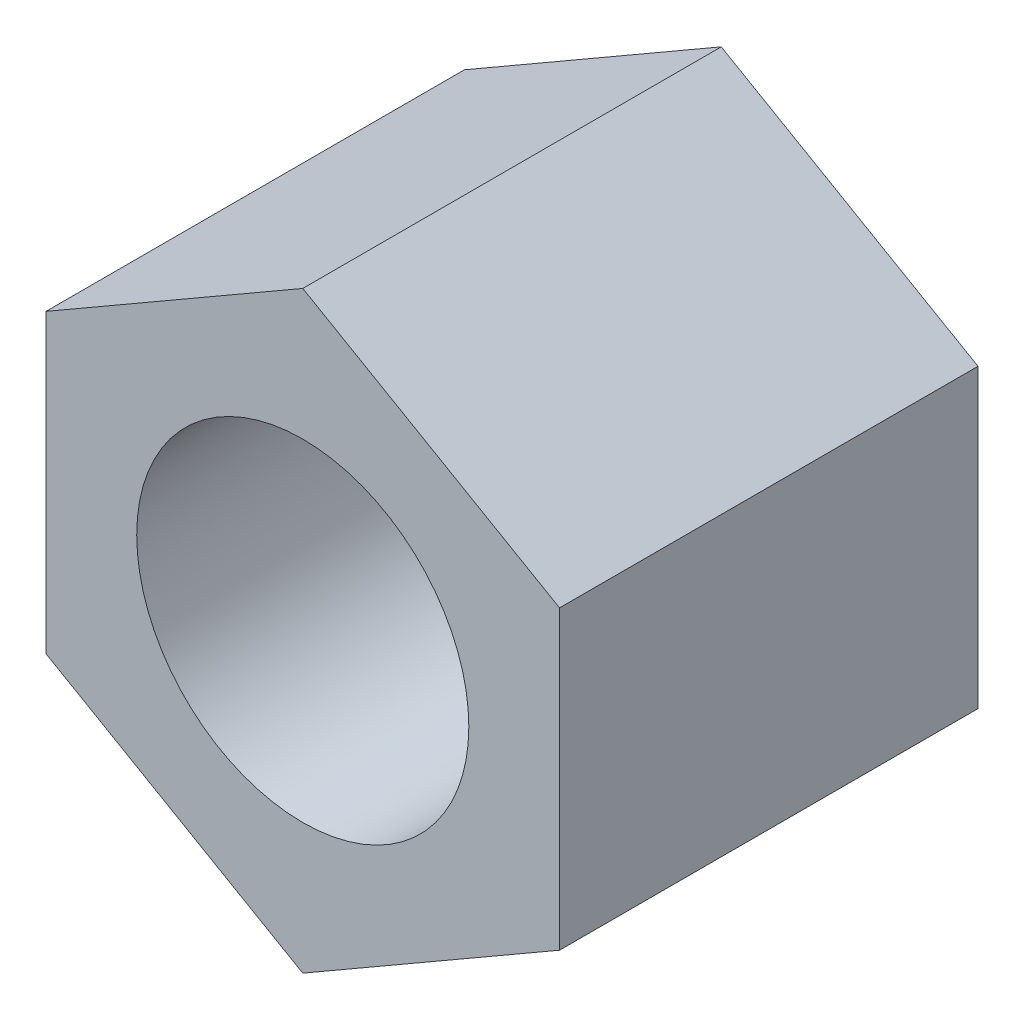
from build123d import *

# Parameters (mm, degrees)
SKETCH1_R      = 22.225
NUT_BODY_DEPTH = 56.007


with BuildPart() as part:
    # Sketch1 → Nut body (new body)
    with BuildSketch(Plane(origin=(0, 0, 0), x_dir=(0, 1, 0), z_dir=(0, 0, 1))):
        Polygon((19.841334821, -34.3662), (39.682669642, 0), (19.841334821, 34.3662), (-19.841334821, 34.3662), (-39.682669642, 0), (-19.841334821, -34.3662), align=None)
        with Locations(Location((0, 0, 0), (0, 0, 270))):
            Circle(SKETCH1_R, mode=Mode.SUBTRACT)
    extrude(amount=NUT_BODY_DEPTH)


solid = part.part
